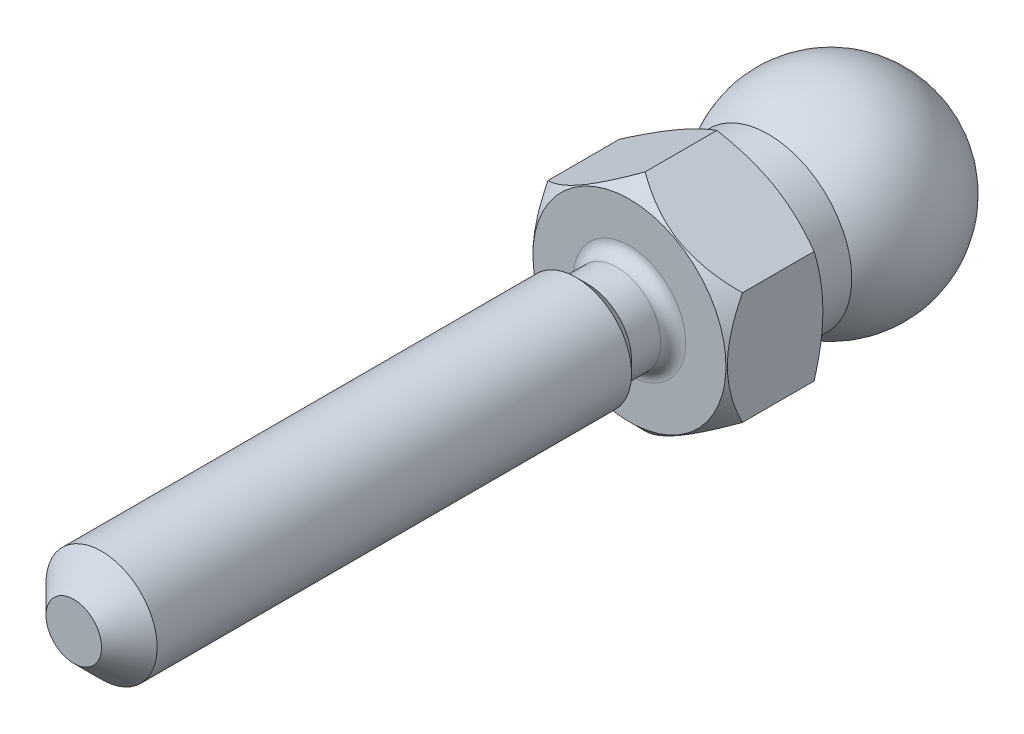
ISO-10303-21;
HEADER;
FILE_DESCRIPTION(('STEP AP214'),'2;1');
FILE_NAME('part.step','',(''),(''),'','','');
FILE_SCHEMA(('AUTOMOTIVE_DESIGN { 1 0 10303 214 1 1 1 1 }'));
ENDSEC;
DATA;
#1=APPLICATION_CONTEXT('core data for automotive mechanical design processes');
#2=APPLICATION_PROTOCOL_DEFINITION('international standard','automotive_design',2000,#1);
#3=PRODUCT_CONTEXT('',#1,'mechanical');
#4=PRODUCT('Part','Part','',(#3));
#5=PRODUCT_RELATED_PRODUCT_CATEGORY('part','',(#4));
#6=PRODUCT_DEFINITION_FORMATION('','',#4);
#7=PRODUCT_DEFINITION_CONTEXT('part definition',#1,'design');
#8=PRODUCT_DEFINITION('design','',#6,#7);
#9=PRODUCT_DEFINITION_SHAPE('','',#8);
#10=(LENGTH_UNIT() NAMED_UNIT(*) SI_UNIT(.MILLI.,.METRE.));
#11=(NAMED_UNIT(*) PLANE_ANGLE_UNIT() SI_UNIT($,.RADIAN.));
#12=(NAMED_UNIT(*) SI_UNIT($,.STERADIAN.) SOLID_ANGLE_UNIT());
#13=UNCERTAINTY_MEASURE_WITH_UNIT(LENGTH_MEASURE(1.E-05),#10,'distance_accuracy_value','');
#14=(GEOMETRIC_REPRESENTATION_CONTEXT(3) GLOBAL_UNCERTAINTY_ASSIGNED_CONTEXT((#13)) GLOBAL_UNIT_ASSIGNED_CONTEXT((#10,
#11,#12)) REPRESENTATION_CONTEXT('',''));
#15=CARTESIAN_POINT('',(0.,0.,0.));
#16=DIRECTION('',(0.,0.,1.));
#17=DIRECTION('',(1.,0.,0.));
#18=AXIS2_PLACEMENT_3D('',#15,#16,#17);
#19=CARTESIAN_POINT('',(0.,0.,-54.5));
#20=DIRECTION('',(-1.,0.,0.));
#21=DIRECTION('',(0.,0.,1.));
#22=AXIS2_PLACEMENT_3D('',#19,#20,#21);
#23=SPHERICAL_SURFACE('',#22,7.50000000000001);
#24=CARTESIAN_POINT('',(7.5,0.,-54.5));
#25=VERTEX_POINT('',#24);
#26=VERTEX_LOOP('',#25);
#27=FACE_BOUND('',#26,.T.);
#28=CARTESIAN_POINT('',(-7.50000000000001,0.,-54.5));
#29=VERTEX_POINT('',#28);
#30=VERTEX_LOOP('',#29);
#31=FACE_BOUND('',#30,.T.);
#32=CARTESIAN_POINT('',(0.,0.,-50.));
#33=DIRECTION('',(0.,0.,-1.));
#34=DIRECTION('',(0.,1.,0.));
#35=AXIS2_PLACEMENT_3D('',#32,#33,#34);
#36=CIRCLE('',#35,6.00000000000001);
#37=CARTESIAN_POINT('',(0.,6.,-50.));
#38=VERTEX_POINT('',#37);
#39=EDGE_CURVE('E20',#38,#38,#36,.F.);
#40=ORIENTED_EDGE('',*,*,#39,.F.);
#41=EDGE_LOOP('',(#40));
#42=FACE_BOUND('',#41,.T.);
#43=ADVANCED_FACE('F16',(#27,#31,#42),#23,.T.);
#44=CARTESIAN_POINT('',(0.,0.,-48.75));
#45=DIRECTION('',(0.,0.,-1.));
#46=DIRECTION('',(0.,1.,0.));
#47=AXIS2_PLACEMENT_3D('',#44,#45,#46);
#48=CYLINDRICAL_SURFACE('',#47,6.00000000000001);
#49=CARTESIAN_POINT('',(0.,0.,-47.5000000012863));
#50=DIRECTION('',(0.,0.,1.));
#51=DIRECTION('',(1.,0.,0.));
#52=AXIS2_PLACEMENT_3D('',#49,#50,#51);
#53=CIRCLE('',#52,6.00000000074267);
#54=CARTESIAN_POINT('',(6.00000000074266,0.,-47.5000000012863));
#55=VERTEX_POINT('',#54);
#56=EDGE_CURVE('E84',#55,#55,#53,.T.);
#57=ORIENTED_EDGE('',*,*,#56,.F.);
#58=EDGE_LOOP('',(#57));
#59=FACE_BOUND('',#58,.T.);
#60=ORIENTED_EDGE('',*,*,#39,.T.);
#61=EDGE_LOOP('',(#60));
#62=FACE_BOUND('',#61,.T.);
#63=ADVANCED_FACE('F80',(#59,#62),#48,.T.);
#64=CARTESIAN_POINT('',(0.,0.,-46.2902195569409));
#65=DIRECTION('',(0.,0.,1.));
#66=DIRECTION('',(0.,-1.,0.));
#67=AXIS2_PLACEMENT_3D('',#64,#65,#66);
#68=CONICAL_SURFACE('',#67,8.09540119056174,1.04719755);
#69=ORIENTED_EDGE('',*,*,#56,.T.);
#70=EDGE_LOOP('',(#69));
#71=FACE_BOUND('',#70,.T.);
#72=CARTESIAN_POINT('',(7.00000000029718,4.04145188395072,-46.2974349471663));
#73=CARTESIAN_POINT('',(7.00000000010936,3.86378247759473,-46.3487137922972));
#74=CARTESIAN_POINT('',(7.00000000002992,3.68545063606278,-46.3976652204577));
#75=CARTESIAN_POINT('',(6.99999999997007,3.32733873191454,-46.4902722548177));
#76=CARTESIAN_POINT('',(6.9999999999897,3.1475580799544,-46.5339255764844));
#77=CARTESIAN_POINT('',(7.00000000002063,2.60533781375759,-46.6560814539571));
#78=CARTESIAN_POINT('',(7.00000000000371,2.24075794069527,-46.7255612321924));
#79=CARTESIAN_POINT('',(6.99999999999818,1.69517083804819,-46.8070325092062));
#80=CARTESIAN_POINT('',(6.99999999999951,1.5157936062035,-46.8302409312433));
#81=CARTESIAN_POINT('',(7.00000000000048,1.15622874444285,-46.8691571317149));
#82=CARTESIAN_POINT('',(7.00000000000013,0.976041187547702,-46.8848655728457));
#83=CARTESIAN_POINT('',(6.99999999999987,0.615353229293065,-46.9083814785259));
#84=CARTESIAN_POINT('',(6.99999999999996,0.434853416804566,-46.9161979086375));
#85=CARTESIAN_POINT('',(7.00000000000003,0.0736971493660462,-46.9237705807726));
#86=CARTESIAN_POINT('',(7.00000000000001,-0.106959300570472,-46.9235270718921));
#87=CARTESIAN_POINT('',(6.99999999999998,-0.601868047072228,-46.911781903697));
#88=CARTESIAN_POINT('',(6.99999999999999,-0.915958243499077,-46.8920747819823));
#89=CARTESIAN_POINT('',(7.,-1.54205253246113,-46.8295900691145));
#90=CARTESIAN_POINT('',(7.,-1.85405442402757,-46.7867911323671));
#91=CARTESIAN_POINT('',(7.,-2.48140815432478,-46.6798088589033));
#92=CARTESIAN_POINT('',(7.,-2.79668085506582,-46.6151723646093));
#93=CARTESIAN_POINT('',(7.,-3.42252533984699,-46.4684746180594));
#94=CARTESIAN_POINT('',(7.,-3.73310513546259,-46.386447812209));
#95=CARTESIAN_POINT('',(7.,-4.04145188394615,-46.2974349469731));
#96=B_SPLINE_CURVE_WITH_KNOTS('',3,(#72,#73,#74,#75,#76,#77,#78,#79,#80,#81,#82,#83,#84,#85,#86,
#87,#88,#89,#90,#91,#92,#93,#94,#95),.UNSPECIFIED.,.F.,.F.,(4,2,2,2,2,2,2,2,2,2,2,4),(0.,
0.554720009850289,1.1096783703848,2.22190068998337,2.76439120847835,3.30683378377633,
3.84865943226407,4.3904683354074,5.33360246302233,6.27760990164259,7.24255090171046,
8.20559812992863),.UNSPECIFIED.);
#97=CARTESIAN_POINT('',(6.99999999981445,4.04145188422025,-46.2974349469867));
#98=VERTEX_POINT('',#97);
#99=CARTESIAN_POINT('',(6.99999999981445,-4.04145188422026,-46.2974349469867));
#100=VERTEX_POINT('',#99);
#101=EDGE_CURVE('E140',#98,#100,#96,.T.);
#102=ORIENTED_EDGE('',*,*,#101,.T.);
#103=CARTESIAN_POINT('',(6.99999999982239,-4.04145188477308,-46.2974349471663));
#104=CARTESIAN_POINT('',(6.84613378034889,-4.13028658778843,-46.3487137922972));
#105=CARTESIAN_POINT('',(6.69169387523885,-4.2194525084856,-46.3976652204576));
#106=CARTESIAN_POINT('',(6.38155986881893,-4.39850846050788,-46.4902722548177));
#107=CARTESIAN_POINT('',(6.22586525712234,-4.48839878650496,-46.5339255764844));
#108=CARTESIAN_POINT('',(5.7562887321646,-4.75950891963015,-46.6560814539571));
#109=CARTESIAN_POINT('',(5.44055330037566,-4.94179885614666,-46.7255612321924));
#110=CARTESIAN_POINT('',(4.96806100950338,-5.21459240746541,-46.8070325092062));
#111=CARTESIAN_POINT('',(4.81271576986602,-5.3042810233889,-46.8302409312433));
#112=CARTESIAN_POINT('',(4.50132346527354,-5.48406345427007,-46.8691571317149));
#113=CARTESIAN_POINT('',(4.34527646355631,-5.57415723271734,-46.8848655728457));
#114=CARTESIAN_POINT('',(4.03291152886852,-5.75450121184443,-46.9083814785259));
#115=CARTESIAN_POINT('',(3.8765941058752,-5.84475111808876,-46.9161979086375));
#116=CARTESIAN_POINT('',(3.56382360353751,-6.02532925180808,-46.9237705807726));
#117=CARTESIAN_POINT('',(3.40737052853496,-6.11565747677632,-46.9235270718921));
#118=CARTESIAN_POINT('',(2.97876698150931,-6.36311185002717,-46.911781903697));
#119=CARTESIAN_POINT('',(2.70675689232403,-6.52015694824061,-46.8920747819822));
#120=CARTESIAN_POINT('',(2.16454333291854,-6.83320409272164,-46.8295900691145));
#121=CARTESIAN_POINT('',(1.8943417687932,-6.98920503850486,-46.7867911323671));
#122=CARTESIAN_POINT('',(1.35103750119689,-7.30288190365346,-46.6798088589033));
#123=CARTESIAN_POINT('',(1.07800333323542,-7.46051825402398,-46.6151723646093));
#124=CARTESIAN_POINT('',(0.536006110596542,-7.77344049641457,-46.4684746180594));
#125=CARTESIAN_POINT('',(0.267036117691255,-7.92873039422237,-46.386447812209));
#126=CARTESIAN_POINT('',(3.30158350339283E-10,-8.08290376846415,-46.2974349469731));
#127=B_SPLINE_CURVE_WITH_KNOTS('',3,(#103,#104,#105,#106,#107,#108,#109,#110,#111,#112,#113,
#114,#115,#116,#117,#118,#119,#120,#121,#122,#123,#124,#125,#126),.UNSPECIFIED.,.F.,.F.,(4,2,2,
2,2,2,2,2,2,2,2,4),(0.,0.554720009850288,1.1096783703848,2.22190068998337,2.76439120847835,
3.30683378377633,3.84865943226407,4.3904683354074,5.33360246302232,6.27760990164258,
7.24255090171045,8.20559812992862),.UNSPECIFIED.);
#128=CARTESIAN_POINT('',(0.,-8.08290376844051,-46.2974349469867));
#129=VERTEX_POINT('',#128);
#130=EDGE_CURVE('E71',#100,#129,#127,.T.);
#131=ORIENTED_EDGE('',*,*,#130,.T.);
#132=CARTESIAN_POINT('',(-4.7479887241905E-10,-8.08290376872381,-46.2974349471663));
#133=CARTESIAN_POINT('',(-0.153866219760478,-7.99406906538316,-46.3487137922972));
#134=CARTESIAN_POINT('',(-0.308306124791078,-7.90490314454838,-46.3976652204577));
#135=CARTESIAN_POINT('',(-0.618440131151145,-7.72584719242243,-46.4902722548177));
#136=CARTESIAN_POINT('',(-0.774134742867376,-7.63595686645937,-46.5339255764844));
#137=CARTESIAN_POINT('',(-1.24371126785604,-7.36484673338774,-46.6560814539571));
#138=CARTESIAN_POINT('',(-1.55944669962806,-7.18255679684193,-46.7255612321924));
#139=CARTESIAN_POINT('',(-2.03193899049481,-6.9097632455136,-46.8070325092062));
#140=CARTESIAN_POINT('',(-2.1872842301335,-6.82007462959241,-46.8302409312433));
#141=CARTESIAN_POINT('',(-2.49867653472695,-6.64029219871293,-46.8691571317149));
#142=CARTESIAN_POINT('',(-2.65472353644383,-6.55019842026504,-46.8848655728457));
#143=CARTESIAN_POINT('',(-2.96708847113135,-6.3698544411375,-46.9083814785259));
#144=CARTESIAN_POINT('',(-3.12340589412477,-6.27960453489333,-46.9161979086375));
#145=CARTESIAN_POINT('',(-3.43617639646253,-6.09902640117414,-46.9237705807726));
#146=CARTESIAN_POINT('',(-3.59262947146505,-6.00869817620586,-46.9235270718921));
#147=CARTESIAN_POINT('',(-4.02123301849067,-5.76124380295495,-46.911781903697));
#148=CARTESIAN_POINT('',(-4.29324310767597,-5.60419870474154,-46.8920747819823));
#149=CARTESIAN_POINT('',(-4.83545666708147,-5.29115156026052,-46.8295900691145));
#150=CARTESIAN_POINT('',(-5.1056582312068,-5.1351506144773,-46.7867911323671));
#151=CARTESIAN_POINT('',(-5.64896249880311,-4.82147374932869,-46.6798088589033));
#152=CARTESIAN_POINT('',(-5.92199666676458,-4.66383739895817,-46.6151723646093));
#153=CARTESIAN_POINT('',(-6.46399388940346,-4.35091515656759,-46.4684746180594));
#154=CARTESIAN_POINT('',(-6.73296388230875,-4.19562525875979,-46.386447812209));
#155=CARTESIAN_POINT('',(-6.99999999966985,-4.04145188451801,-46.2974349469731));
#156=B_SPLINE_CURVE_WITH_KNOTS('',3,(#132,#133,#134,#135,#136,#137,#138,#139,#140,#141,#142,
#143,#144,#145,#146,#147,#148,#149,#150,#151,#152,#153,#154,#155),.UNSPECIFIED.,.F.,.F.,(4,2,2,
2,2,2,2,2,2,2,2,4),(0.,0.554720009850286,1.1096783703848,2.22190068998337,2.76439120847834,
3.30683378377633,3.84865943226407,4.39046833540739,5.33360246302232,6.27760990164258,
7.24255090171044,8.20559812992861),.UNSPECIFIED.);
#157=CARTESIAN_POINT('',(-6.99999999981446,-4.04145188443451,-46.2974349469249));
#158=VERTEX_POINT('',#157);
#159=EDGE_CURVE('E86',#129,#158,#156,.T.);
#160=ORIENTED_EDGE('',*,*,#159,.T.);
#161=CARTESIAN_POINT('',(-7.00000000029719,-4.04145188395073,-46.2974349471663));
#162=CARTESIAN_POINT('',(-7.00000000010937,-3.86378247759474,-46.3487137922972));
#163=CARTESIAN_POINT('',(-7.00000000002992,-3.6854506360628,-46.3976652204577));
#164=CARTESIAN_POINT('',(-6.99999999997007,-3.32733873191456,-46.4902722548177));
#165=CARTESIAN_POINT('',(-6.99999999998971,-3.14755807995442,-46.5339255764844));
#166=CARTESIAN_POINT('',(-7.00000000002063,-2.6053378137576,-46.6560814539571));
#167=CARTESIAN_POINT('',(-7.00000000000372,-2.24075794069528,-46.7255612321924));
#168=CARTESIAN_POINT('',(-6.99999999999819,-1.6951708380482,-46.8070325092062));
#169=CARTESIAN_POINT('',(-6.99999999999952,-1.51579360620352,-46.8302409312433));
#170=CARTESIAN_POINT('',(-7.00000000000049,-1.15622874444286,-46.8691571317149));
#171=CARTESIAN_POINT('',(-7.00000000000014,-0.976041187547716,-46.8848655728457));
#172=CARTESIAN_POINT('',(-6.99999999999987,-0.615353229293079,-46.9083814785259));
#173=CARTESIAN_POINT('',(-6.99999999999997,-0.43485341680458,-46.9161979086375));
#174=CARTESIAN_POINT('',(-7.00000000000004,-0.0736971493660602,-46.9237705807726));
#175=CARTESIAN_POINT('',(-7.00000000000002,0.106959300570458,-46.9235270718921));
#176=CARTESIAN_POINT('',(-6.99999999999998,0.601868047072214,-46.911781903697));
#177=CARTESIAN_POINT('',(-7.,0.915958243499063,-46.8920747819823));
#178=CARTESIAN_POINT('',(-7.00000000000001,1.54205253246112,-46.8295900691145));
#179=CARTESIAN_POINT('',(-7.00000000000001,1.85405442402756,-46.7867911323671));
#180=CARTESIAN_POINT('',(-7.,2.48140815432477,-46.6798088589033));
#181=CARTESIAN_POINT('',(-7.,2.79668085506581,-46.6151723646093));
#182=CARTESIAN_POINT('',(-7.00000000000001,3.42252533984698,-46.4684746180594));
#183=CARTESIAN_POINT('',(-7.00000000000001,3.73310513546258,-46.386447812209));
#184=CARTESIAN_POINT('',(-7.,4.04145188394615,-46.2974349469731));
#185=B_SPLINE_CURVE_WITH_KNOTS('',3,(#161,#162,#163,#164,#165,#166,#167,#168,#169,#170,#171,
#172,#173,#174,#175,#176,#177,#178,#179,#180,#181,#182,#183,#184),.UNSPECIFIED.,.F.,.F.,(4,2,2,
2,2,2,2,2,2,2,2,4),(0.,0.554720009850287,1.1096783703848,2.22190068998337,2.76439120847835,
3.30683378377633,3.84865943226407,4.3904683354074,5.33360246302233,6.27760990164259,
7.24255090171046,8.20559812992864),.UNSPECIFIED.);
#186=CARTESIAN_POINT('',(-6.99999999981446,4.04145188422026,-46.2974349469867));
#187=VERTEX_POINT('',#186);
#188=EDGE_CURVE('E121',#158,#187,#185,.T.);
#189=ORIENTED_EDGE('',*,*,#188,.T.);
#190=CARTESIAN_POINT('',(-6.9999999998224,4.04145188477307,-46.2974349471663));
#191=CARTESIAN_POINT('',(-6.8461337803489,4.13028658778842,-46.3487137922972));
#192=CARTESIAN_POINT('',(-6.69169387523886,4.21945250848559,-46.3976652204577));
#193=CARTESIAN_POINT('',(-6.38155986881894,4.39850846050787,-46.4902722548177));
#194=CARTESIAN_POINT('',(-6.22586525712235,4.48839878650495,-46.5339255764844));
#195=CARTESIAN_POINT('',(-5.75628873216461,4.75950891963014,-46.6560814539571));
#196=CARTESIAN_POINT('',(-5.44055330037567,4.94179885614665,-46.7255612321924));
#197=CARTESIAN_POINT('',(-4.96806100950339,5.2145924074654,-46.8070325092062));
#198=CARTESIAN_POINT('',(-4.81271576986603,5.30428102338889,-46.8302409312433));
#199=CARTESIAN_POINT('',(-4.50132346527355,5.48406345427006,-46.8691571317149));
#200=CARTESIAN_POINT('',(-4.34527646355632,5.57415723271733,-46.8848655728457));
#201=CARTESIAN_POINT('',(-4.03291152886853,5.75450121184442,-46.9083814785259));
#202=CARTESIAN_POINT('',(-3.87659410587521,5.84475111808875,-46.9161979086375));
#203=CARTESIAN_POINT('',(-3.56382360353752,6.02532925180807,-46.9237705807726));
#204=CARTESIAN_POINT('',(-3.40737052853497,6.11565747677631,-46.9235270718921));
#205=CARTESIAN_POINT('',(-2.97876698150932,6.36311185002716,-46.911781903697));
#206=CARTESIAN_POINT('',(-2.70675689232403,6.5201569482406,-46.8920747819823));
#207=CARTESIAN_POINT('',(-2.16454333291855,6.83320409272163,-46.8295900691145));
#208=CARTESIAN_POINT('',(-1.89434176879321,6.98920503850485,-46.7867911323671));
#209=CARTESIAN_POINT('',(-1.35103750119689,7.30288190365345,-46.6798088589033));
#210=CARTESIAN_POINT('',(-1.07800333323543,7.46051825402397,-46.6151723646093));
#211=CARTESIAN_POINT('',(-0.536006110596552,7.77344049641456,-46.4684746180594));
#212=CARTESIAN_POINT('',(-0.267036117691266,7.92873039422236,-46.386447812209));
#213=CARTESIAN_POINT('',(-3.30168395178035E-10,8.08290376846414,-46.2974349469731));
#214=B_SPLINE_CURVE_WITH_KNOTS('',3,(#190,#191,#192,#193,#194,#195,#196,#197,#198,#199,#200,
#201,#202,#203,#204,#205,#206,#207,#208,#209,#210,#211,#212,#213),.UNSPECIFIED.,.F.,.F.,(4,2,2,
2,2,2,2,2,2,2,2,4),(0.,0.554720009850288,1.10967837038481,2.22190068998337,2.76439120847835,
3.30683378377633,3.84865943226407,4.3904683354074,5.33360246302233,6.27760990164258,
7.24255090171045,8.20559812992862),.UNSPECIFIED.);
#215=CARTESIAN_POINT('',(0.,8.0829037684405,-46.2974349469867));
#216=VERTEX_POINT('',#215);
#217=EDGE_CURVE('E129',#187,#216,#214,.T.);
#218=ORIENTED_EDGE('',*,*,#217,.T.);
#219=CARTESIAN_POINT('',(4.74782038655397E-10,8.0829037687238,-46.2974349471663));
#220=CARTESIAN_POINT('',(0.153866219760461,7.99406906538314,-46.3487137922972));
#221=CARTESIAN_POINT('',(0.308306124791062,7.90490314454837,-46.3976652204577));
#222=CARTESIAN_POINT('',(0.618440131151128,7.72584719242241,-46.4902722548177));
#223=CARTESIAN_POINT('',(0.774134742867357,7.63595686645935,-46.5339255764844));
#224=CARTESIAN_POINT('',(1.24371126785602,7.36484673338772,-46.6560814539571));
#225=CARTESIAN_POINT('',(1.55944669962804,7.18255679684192,-46.7255612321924));
#226=CARTESIAN_POINT('',(2.03193899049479,6.90976324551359,-46.8070325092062));
#227=CARTESIAN_POINT('',(2.18728423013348,6.8200746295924,-46.8302409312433));
#228=CARTESIAN_POINT('',(2.49867653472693,6.64029219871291,-46.8691571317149));
#229=CARTESIAN_POINT('',(2.65472353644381,6.55019842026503,-46.8848655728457));
#230=CARTESIAN_POINT('',(2.96708847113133,6.36985444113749,-46.9083814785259));
#231=CARTESIAN_POINT('',(3.12340589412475,6.27960453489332,-46.9161979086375));
#232=CARTESIAN_POINT('',(3.43617639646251,6.09902640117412,-46.9237705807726));
#233=CARTESIAN_POINT('',(3.59262947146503,6.00869817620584,-46.9235270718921));
#234=CARTESIAN_POINT('',(4.02123301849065,5.76124380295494,-46.911781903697));
#235=CARTESIAN_POINT('',(4.29324310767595,5.60419870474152,-46.8920747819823));
#236=CARTESIAN_POINT('',(4.83545666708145,5.29115156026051,-46.8295900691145));
#237=CARTESIAN_POINT('',(5.10565823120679,5.13515061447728,-46.7867911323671));
#238=CARTESIAN_POINT('',(5.6489624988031,4.82147374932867,-46.6798088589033));
#239=CARTESIAN_POINT('',(5.92199666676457,4.66383739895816,-46.6151723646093));
#240=CARTESIAN_POINT('',(6.46399388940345,4.35091515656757,-46.4684746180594));
#241=CARTESIAN_POINT('',(6.73296388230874,4.19562525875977,-46.386447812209));
#242=CARTESIAN_POINT('',(6.99999999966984,4.04145188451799,-46.2974349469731));
#243=B_SPLINE_CURVE_WITH_KNOTS('',3,(#219,#220,#221,#222,#223,#224,#225,#226,#227,#228,#229,
#230,#231,#232,#233,#234,#235,#236,#237,#238,#239,#240,#241,#242),.UNSPECIFIED.,.F.,.F.,(4,2,2,
2,2,2,2,2,2,2,2,4),(0.,0.554720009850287,1.1096783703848,2.22190068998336,2.76439120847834,
3.30683378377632,3.84865943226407,4.39046833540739,5.33360246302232,6.27760990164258,
7.24255090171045,8.20559812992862),.UNSPECIFIED.);
#244=EDGE_CURVE('E135',#216,#98,#243,.T.);
#245=ORIENTED_EDGE('',*,*,#244,.T.);
#246=EDGE_LOOP('',(#102,#131,#160,#189,#218,#245));
#247=FACE_BOUND('',#246,.T.);
#248=ADVANCED_FACE('F103',(#71,#247),#68,.T.);
#249=CARTESIAN_POINT('',(0.,-8.08290376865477,-40.));
#250=DIRECTION('',(0.5,0.866025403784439,0.));
#251=DIRECTION('',(-0.866025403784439,0.5,0.));
#252=AXIS2_PLACEMENT_3D('',#249,#250,#251);
#253=PLANE('',#252);
#254=DIRECTION('',(0.,0.,-1.));
#255=VECTOR('',#254,1.);
#256=CARTESIAN_POINT('',(-7.,-4.04145188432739,-40.));
#257=LINE('',#256,#255);
#258=CARTESIAN_POINT('',(-6.99999996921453,-4.04145190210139,-41.1329037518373));
#259=VERTEX_POINT('',#258);
#260=EDGE_CURVE('E255',#259,#158,#257,.T.);
#261=ORIENTED_EDGE('',*,*,#260,.T.);
#262=ORIENTED_EDGE('',*,*,#159,.F.);
#263=DIRECTION('',(0.,0.,1.));
#264=VECTOR('',#263,1.);
#265=CARTESIAN_POINT('',(0.,-8.08290376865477,-40.));
#266=LINE('',#265,#264);
#267=CARTESIAN_POINT('',(-5.95870114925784E-09,-8.08290377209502,-41.1329037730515));
#268=VERTEX_POINT('',#267);
#269=EDGE_CURVE('E92',#129,#268,#266,.T.);
#270=ORIENTED_EDGE('',*,*,#269,.T.);
#271=CARTESIAN_POINT('',(-6.99999993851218,-4.04145191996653,-41.1329037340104));
#272=CARTESIAN_POINT('',(-6.87964650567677,-4.11093800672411,-41.0634280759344));
#273=CARTESIAN_POINT('',(-6.75836801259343,-4.18095817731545,-40.996084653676));
#274=CARTESIAN_POINT('',(-6.51377945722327,-4.322171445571,-40.8663108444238));
#275=CARTESIAN_POINT('',(-6.39046832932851,-4.39336515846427,-40.8038831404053));
#276=CARTESIAN_POINT('',(-6.01606848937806,-4.60952500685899,-40.6244142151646));
#277=CARTESIAN_POINT('',(-5.76181050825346,-4.75632092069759,-40.5159526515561));
#278=CARTESIAN_POINT('',(-5.24907912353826,-5.05234652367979,-40.3302203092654));
#279=CARTESIAN_POINT('',(-4.99073673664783,-5.20150057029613,-40.252481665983));
#280=CARTESIAN_POINT('',(-4.5989764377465,-5.42768348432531,-40.1625576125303));
#281=CARTESIAN_POINT('',(-4.46781295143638,-5.50341075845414,-40.1370422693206));
#282=CARTESIAN_POINT('',(-4.20437555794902,-5.65550640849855,-40.0954835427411));
#283=CARTESIAN_POINT('',(-4.07210181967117,-5.73187468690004,-40.0794387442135));
#284=CARTESIAN_POINT('',(-3.74975742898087,-5.91798030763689,-40.0525366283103));
#285=CARTESIAN_POINT('',(-3.55933944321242,-6.02791818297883,-40.0468928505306));
#286=CARTESIAN_POINT('',(-3.17884679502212,-6.24759571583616,-40.0563708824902));
#287=CARTESIAN_POINT('',(-2.98877227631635,-6.35733529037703,-40.0714999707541));
#288=CARTESIAN_POINT('',(-2.61041536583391,-6.57577975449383,-40.1216319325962));
#289=CARTESIAN_POINT('',(-2.42213521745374,-6.68448334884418,-40.1566570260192));
#290=CARTESIAN_POINT('',(-2.04881104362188,-6.900022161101,-40.2446768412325));
#291=CARTESIAN_POINT('',(-1.8637667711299,-7.00685752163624,-40.2976701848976));
#292=CARTESIAN_POINT('',(-1.53530254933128,-7.19649642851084,-40.4066858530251));
#293=CARTESIAN_POINT('',(-1.39115484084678,-7.27972014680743,-40.4598394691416));
#294=CARTESIAN_POINT('',(-1.10544664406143,-7.44467385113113,-40.5747109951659));
#295=CARTESIAN_POINT('',(-0.96388623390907,-7.52640379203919,-40.636429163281));
#296=CARTESIAN_POINT('',(-0.683798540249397,-7.68811249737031,-40.7670466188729));
#297=CARTESIAN_POINT('',(-0.545263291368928,-7.7680958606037,-40.8359233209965));
#298=CARTESIAN_POINT('',(-0.270757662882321,-7.92658175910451,-40.9799538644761));
#299=CARTESIAN_POINT('',(-0.134785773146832,-8.00508516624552,-41.0551038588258));
#300=CARTESIAN_POINT('',(-6.15624390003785E-08,-8.08290373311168,-41.1329037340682));
#301=B_SPLINE_CURVE_WITH_KNOTS('',3,(#271,#272,#273,#274,#275,#276,#277,#278,#279,#280,#281,
#282,#283,#284,#285,#286,#287,#288,#289,#290,#291,#292,#293,#294,#295,#296,#297,#298,#299,#300),
.UNSPECIFIED.,.F.,.F.,(4,2,2,2,2,2,2,2,2,2,2,2,2,2,4),(0.,0.466085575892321,0.932423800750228,
1.87013394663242,2.79295642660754,3.2534628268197,3.71390039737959,4.37271966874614,
5.03176984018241,5.69155748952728,6.35129454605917,6.87523426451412,7.39918978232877,
7.9215396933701,8.44357160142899),.UNSPECIFIED.);
#302=EDGE_CURVE('E254',#259,#268,#301,.T.);
#303=ORIENTED_EDGE('',*,*,#302,.F.);
#304=EDGE_LOOP('',(#261,#262,#270,#303));
#305=FACE_BOUND('',#304,.T.);
#306=ADVANCED_FACE('F108',(#305),#253,.F.);
#307=CARTESIAN_POINT('',(7.,-4.04145188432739,-40.));
#308=DIRECTION('',(-0.5,0.866025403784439,0.));
#309=DIRECTION('',(-0.866025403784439,-0.5,0.));
#310=AXIS2_PLACEMENT_3D('',#307,#308,#309);
#311=PLANE('',#310);
#312=ORIENTED_EDGE('',*,*,#269,.F.);
#313=ORIENTED_EDGE('',*,*,#130,.F.);
#314=DIRECTION('',(0.,0.,1.));
#315=VECTOR('',#314,1.);
#316=CARTESIAN_POINT('',(7.,-4.04145188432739,-40.));
#317=LINE('',#316,#315);
#318=CARTESIAN_POINT('',(7.,-4.04145189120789,-41.1329037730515));
#319=VERTEX_POINT('',#318);
#320=EDGE_CURVE('E145',#100,#319,#317,.T.);
#321=ORIENTED_EDGE('',*,*,#320,.T.);
#322=CARTESIAN_POINT('',(-2.13753986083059E-08,-8.0829037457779,-41.1329037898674));
#323=CARTESIAN_POINT('',(0.120353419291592,-8.01341767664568,-41.0634281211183));
#324=CARTESIAN_POINT('',(0.241631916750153,-7.94339751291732,-40.9960846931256));
#325=CARTESIAN_POINT('',(0.486220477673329,-7.80218424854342,-40.8663108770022));
#326=CARTESIAN_POINT('',(0.609531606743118,-7.73099053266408,-40.8038831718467));
#327=CARTESIAN_POINT('',(0.983931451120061,-7.51483067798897,-40.6244142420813));
#328=CARTESIAN_POINT('',(1.23818943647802,-7.36803476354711,-40.5159526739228));
#329=CARTESIAN_POINT('',(1.75092082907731,-7.07200915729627,-40.3302203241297));
#330=CARTESIAN_POINT('',(2.00926321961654,-6.92285510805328,-40.2524816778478));
#331=CARTESIAN_POINT('',(2.4010235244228,-6.69667219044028,-40.1625576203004));
#332=CARTESIAN_POINT('',(2.53218701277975,-6.62094491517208,-40.1370422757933));
#333=CARTESIAN_POINT('',(2.79562441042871,-6.46884926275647,-40.0954835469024));
#334=CARTESIAN_POINT('',(2.92789815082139,-6.39248098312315,-40.0794387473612));
#335=CARTESIAN_POINT('',(3.25024254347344,-6.20637536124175,-40.0525366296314));
#336=CARTESIAN_POINT('',(3.4406605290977,-6.0964374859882,-40.0468928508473));
#337=CARTESIAN_POINT('',(3.82115317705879,-5.87675995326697,-40.0563708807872));
#338=CARTESIAN_POINT('',(4.01122769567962,-5.76702037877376,-40.0714999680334));
#339=CARTESIAN_POINT('',(4.38958460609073,-5.54857591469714,-40.1216319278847));
#340=CARTESIAN_POINT('',(4.57786475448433,-5.4398723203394,-40.1566570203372));
#341=CARTESIAN_POINT('',(4.95118892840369,-5.22433350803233,-40.2446768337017));
#342=CARTESIAN_POINT('',(5.13623320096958,-5.11749814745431,-40.2976701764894));
#343=CARTESIAN_POINT('',(5.46469742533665,-4.92785923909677,-40.4066858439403));
#344=CARTESIAN_POINT('',(5.60884513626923,-4.84463551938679,-40.4598394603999));
#345=CARTESIAN_POINT('',(5.89455333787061,-4.67968181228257,-40.5747109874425));
#346=CARTESIAN_POINT('',(6.0361137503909,-4.59795187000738,-40.6364291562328));
#347=CARTESIAN_POINT('',(6.31620144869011,-4.43624316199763,-40.7670466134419));
#348=CARTESIAN_POINT('',(6.45473669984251,-4.35625979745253,-40.8359233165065));
#349=CARTESIAN_POINT('',(6.72924233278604,-4.19777389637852,-40.9799538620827));
#350=CARTESIAN_POINT('',(6.86521422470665,-4.11927048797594,-41.0551038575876));
#351=CARTESIAN_POINT('',(6.99999993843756,-4.04145191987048,-41.1329037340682));
#352=B_SPLINE_CURVE_WITH_KNOTS('',3,(#322,#323,#324,#325,#326,#327,#328,#329,#330,#331,#332,
#333,#334,#335,#336,#337,#338,#339,#340,#341,#342,#343,#344,#345,#346,#347,#348,#349,#350,#351),
.UNSPECIFIED.,.F.,.F.,(4,2,2,2,2,2,2,2,2,2,2,2,2,2,4),(0.,0.466085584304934,0.932423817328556,
1.87013397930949,2.79295647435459,3.25346288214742,3.71390046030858,4.37271973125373,
5.03176990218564,5.69155755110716,6.35129460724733,6.87523433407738,7.39918986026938,
7.92153977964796,8.44357169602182),.UNSPECIFIED.);
#353=EDGE_CURVE('E165',#268,#319,#352,.T.);
#354=ORIENTED_EDGE('',*,*,#353,.F.);
#355=EDGE_LOOP('',(#312,#313,#321,#354));
#356=FACE_BOUND('',#355,.T.);
#357=ADVANCED_FACE('F150',(#356),#311,.F.);
#358=CARTESIAN_POINT('',(7.,4.04145188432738,-40.));
#359=DIRECTION('',(-1.,0.,0.));
#360=DIRECTION('',(0.,0.,1.));
#361=AXIS2_PLACEMENT_3D('',#358,#359,#360);
#362=PLANE('',#361);
#363=ORIENTED_EDGE('',*,*,#320,.F.);
#364=ORIENTED_EDGE('',*,*,#101,.F.);
#365=DIRECTION('',(0.,0.,1.));
#366=VECTOR('',#365,1.);
#367=CARTESIAN_POINT('',(6.99999999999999,4.04145188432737,-40.));
#368=LINE('',#367,#366);
#369=CARTESIAN_POINT('',(7.00000000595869,4.04145188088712,-41.1329037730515));
#370=VERTEX_POINT('',#369);
#371=EDGE_CURVE('E260',#98,#370,#368,.T.);
#372=ORIENTED_EDGE('',*,*,#371,.T.);
#373=CARTESIAN_POINT('',(6.99999996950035,-4.04145189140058,-41.1329037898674));
#374=CARTESIAN_POINT('',(6.99999998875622,-3.90247971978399,-41.0634281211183));
#375=CARTESIAN_POINT('',(6.9999999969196,-3.7624393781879,-40.9960846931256));
#376=CARTESIAN_POINT('',(7.00000000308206,-3.4800128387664,-40.8663108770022));
#377=CARTESIAN_POINT('',(7.00000000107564,-3.33762541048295,-40.8038831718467));
#378=CARTESIAN_POINT('',(6.99999999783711,-2.90530570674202,-40.6244142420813));
#379=CARTESIAN_POINT('',(6.99999999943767,-2.61171387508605,-40.5159526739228));
#380=CARTESIAN_POINT('',(7.0000000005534,-2.01966266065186,-40.3302203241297));
#381=CARTESIAN_POINT('',(7.00000000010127,-1.721354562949,-40.2524816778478));
#382=CARTESIAN_POINT('',(6.99999999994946,-1.26898872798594,-40.1625576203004));
#383=CARTESIAN_POINT('',(6.9999999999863,-1.11753417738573,-40.1370422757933));
#384=CARTESIAN_POINT('',(7.00000000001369,-0.813342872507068,-40.0954835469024));
#385=CARTESIAN_POINT('',(7.00000000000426,-0.66060631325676,-40.0794387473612));
#386=CARTESIAN_POINT('',(6.99999999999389,-0.288395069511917,-40.0525366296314));
#387=CARTESIAN_POINT('',(6.99999999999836,-0.0685193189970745,-40.0468928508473));
#388=CARTESIAN_POINT('',(7.00000000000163,0.370835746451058,-40.0563708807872));
#389=CARTESIAN_POINT('',(7.00000000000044,0.590314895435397,-40.0714999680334));
#390=CARTESIAN_POINT('',(6.99999999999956,1.02720382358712,-40.1216319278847));
#391=CARTESIAN_POINT('',(6.99999999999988,1.24461101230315,-40.1566570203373));
#392=CARTESIAN_POINT('',(7.00000000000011,1.67568863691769,-40.2446768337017));
#393=CARTESIAN_POINT('',(7.00000000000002,1.88935935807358,-40.2976701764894));
#394=CARTESIAN_POINT('',(6.99999999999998,2.26863717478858,-40.4066858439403));
#395=CARTESIAN_POINT('',(6.99999999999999,2.43508461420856,-40.4598394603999));
#396=CARTESIAN_POINT('',(7.,2.76499202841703,-40.5747109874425));
#397=CARTESIAN_POINT('',(7.,2.9284519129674,-40.6364291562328));
#398=CARTESIAN_POINT('',(7.,3.2518693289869,-40.767046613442));
#399=CARTESIAN_POINT('',(7.,3.41183605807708,-40.8359233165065));
#400=CARTESIAN_POINT('',(7.,3.72880786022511,-40.9799538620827));
#401=CARTESIAN_POINT('',(7.,3.88581467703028,-41.0551038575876));
#402=CARTESIAN_POINT('',(7.,4.0414518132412,-41.1329037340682));
#403=B_SPLINE_CURVE_WITH_KNOTS('',3,(#373,#374,#375,#376,#377,#378,#379,#380,#381,#382,#383,
#384,#385,#386,#387,#388,#389,#390,#391,#392,#393,#394,#395,#396,#397,#398,#399,#400,#401,#402),
.UNSPECIFIED.,.F.,.F.,(4,2,2,2,2,2,2,2,2,2,2,2,2,2,4),(0.,0.466085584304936,0.932423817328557,
1.87013397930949,2.79295647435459,3.25346288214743,3.71390046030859,4.37271973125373,
5.03176990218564,5.69155755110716,6.35129460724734,6.87523433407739,7.39918986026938,
7.92153977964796,8.44357169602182),.UNSPECIFIED.);
#404=EDGE_CURVE('E156',#319,#370,#403,.T.);
#405=ORIENTED_EDGE('',*,*,#404,.F.);
#406=EDGE_LOOP('',(#363,#364,#372,#405));
#407=FACE_BOUND('',#406,.T.);
#408=ADVANCED_FACE('F146',(#407),#362,.F.);
#409=CARTESIAN_POINT('',(0.,8.08290376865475,-40.));
#410=DIRECTION('',(-0.5,-0.866025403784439,0.));
#411=DIRECTION('',(0.866025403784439,-0.5,0.));
#412=AXIS2_PLACEMENT_3D('',#409,#410,#411);
#413=PLANE('',#412);
#414=ORIENTED_EDGE('',*,*,#371,.F.);
#415=ORIENTED_EDGE('',*,*,#244,.F.);
#416=DIRECTION('',(0.,0.,1.));
#417=VECTOR('',#416,1.);
#418=CARTESIAN_POINT('',(0.,8.08290376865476,-40.));
#419=LINE('',#418,#417);
#420=CARTESIAN_POINT('',(-1.24133965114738E-08,8.08290376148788,-41.1329037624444));
#421=VERTEX_POINT('',#420);
#422=EDGE_CURVE('E258',#216,#421,#419,.T.);
#423=ORIENTED_EDGE('',*,*,#422,.T.);
#424=CARTESIAN_POINT('',(6.99999999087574,4.04145185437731,-41.1329037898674));
#425=CARTESIAN_POINT('',(6.87964656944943,4.11093795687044,-41.0634281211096));
#426=CARTESIAN_POINT('',(6.75836808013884,4.18095813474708,-40.9960846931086));
#427=CARTESIAN_POINT('',(6.51377952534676,4.32217140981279,-40.86631087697));
#428=CARTESIAN_POINT('',(6.39046839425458,4.39336512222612,-40.8038831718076));
#429=CARTESIAN_POINT('',(6.01606854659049,4.60952497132,-40.624414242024));
#430=CARTESIAN_POINT('',(5.76181056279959,4.75632088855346,-40.5159526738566));
#431=CARTESIAN_POINT('',(5.24907917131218,5.05234649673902,-40.3302203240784));
#432=CARTESIAN_POINT('',(4.99073678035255,5.20150054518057,-40.2524816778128));
#433=CARTESIAN_POINT('',(4.59897647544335,5.42768346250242,-40.1625576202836));
#434=CARTESIAN_POINT('',(4.46781298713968,5.50341073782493,-40.1370422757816));
#435=CARTESIAN_POINT('',(4.20437558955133,5.65550639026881,-40.0954835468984));
#436=CARTESIAN_POINT('',(4.072101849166,5.73187466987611,-40.0794387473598));
#437=CARTESIAN_POINT('',(3.74975745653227,5.91798029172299,-40.0525366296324));
#438=CARTESIAN_POINT('',(3.55933947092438,6.02791816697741,-40.046892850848));
#439=CARTESIAN_POINT('',(3.17884682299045,6.24759569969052,-40.0563708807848));
#440=CARTESIAN_POINT('',(2.98877230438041,6.35733527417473,-40.071499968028));
#441=CARTESIAN_POINT('',(2.61041539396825,6.57577973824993,-40.1216319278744));
#442=CARTESIAN_POINT('',(2.42213524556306,6.6844833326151,-40.1566570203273));
#443=CARTESIAN_POINT('',(2.0488110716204,6.90002214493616,-40.2446768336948));
#444=CARTESIAN_POINT('',(1.8637667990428,7.00685750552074,-40.2976701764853));
#445=CARTESIAN_POINT('',(1.53530257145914,7.19649641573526,-40.4066858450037));
#446=CARTESIAN_POINT('',(1.39115485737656,7.27972013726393,-40.459839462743));
#447=CARTESIAN_POINT('',(1.10544664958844,7.4446738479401,-40.5747109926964));
#448=CARTESIAN_POINT('',(0.963886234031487,7.5264037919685,-40.6364291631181));
#449=CARTESIAN_POINT('',(0.683798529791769,7.688112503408,-40.7670466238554));
#450=CARTESIAN_POINT('',(0.54526327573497,7.76809586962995,-40.8359233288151));
#451=CARTESIAN_POINT('',(0.270757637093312,7.92658177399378,-40.97995387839));
#452=CARTESIAN_POINT('',(0.134785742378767,8.00508518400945,-41.055103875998));
#453=CARTESIAN_POINT('',(2.58989137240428E-08,8.082903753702,-41.1329037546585));
#454=B_SPLINE_CURVE_WITH_KNOTS('',3,(#424,#425,#426,#427,#428,#429,#430,#431,#432,#433,#434,
#435,#436,#437,#438,#439,#440,#441,#442,#443,#444,#445,#446,#447,#448,#449,#450,#451,#452,#453),
.UNSPECIFIED.,.F.,.F.,(4,2,2,2,2,2,2,2,2,2,2,2,2,2,4),(0.,0.466085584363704,0.932423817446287,
1.87013397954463,2.79295647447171,3.25346288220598,3.71390046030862,4.37271973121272,
5.03176990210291,5.69155755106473,6.35129460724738,6.87523434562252,7.39918988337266,
7.92153981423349,8.44357174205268),.UNSPECIFIED.);
#455=EDGE_CURVE('E164',#370,#421,#454,.T.);
#456=ORIENTED_EDGE('',*,*,#455,.F.);
#457=EDGE_LOOP('',(#414,#415,#423,#456));
#458=FACE_BOUND('',#457,.T.);
#459=ADVANCED_FACE('F149',(#458),#413,.F.);
#460=CARTESIAN_POINT('',(-7.,4.04145188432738,-40.));
#461=DIRECTION('',(0.5,-0.866025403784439,0.));
#462=DIRECTION('',(0.866025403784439,0.5,0.));
#463=AXIS2_PLACEMENT_3D('',#460,#461,#462);
#464=PLANE('',#463);
#465=ORIENTED_EDGE('',*,*,#422,.F.);
#466=ORIENTED_EDGE('',*,*,#217,.F.);
#467=DIRECTION('',(0.,0.,-1.));
#468=VECTOR('',#467,1.);
#469=CARTESIAN_POINT('',(-7.,4.04145188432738,-40.));
#470=LINE('',#469,#468);
#471=CARTESIAN_POINT('',(-7.,4.04145189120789,-41.1329037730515));
#472=VERTEX_POINT('',#471);
#473=EDGE_CURVE('E35',#187,#472,#470,.F.);
#474=ORIENTED_EDGE('',*,*,#473,.T.);
#475=CARTESIAN_POINT('',(-2.01164661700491E-08,8.0829037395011,-41.1329037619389));
#476=CARTESIAN_POINT('',(-0.120353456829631,8.01341766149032,-41.0634280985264));
#477=CARTESIAN_POINT('',(-0.241631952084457,7.94339749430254,-40.9960846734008));
#478=CARTESIAN_POINT('',(-0.486220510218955,7.80218422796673,-40.866310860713));
#479=CARTESIAN_POINT('',(-0.609531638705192,7.73099051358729,-40.803883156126));
#480=CARTESIAN_POINT('',(-0.983931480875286,7.51483066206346,-40.6244142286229));
#481=CARTESIAN_POINT('',(-1.2381894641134,7.36803474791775,-40.5159526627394));
#482=CARTESIAN_POINT('',(-1.75092085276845,7.07200914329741,-40.3302203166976));
#483=CARTESIAN_POINT('',(-2.00926324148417,6.92285509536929,-40.2524816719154));
#484=CARTESIAN_POINT('',(-2.40102354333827,6.69667217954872,-40.1625576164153));
#485=CARTESIAN_POINT('',(-2.53218703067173,6.62094490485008,-40.137042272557));
#486=CARTESIAN_POINT('',(-2.79562442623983,6.46884925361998,-40.0954835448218));
#487=CARTESIAN_POINT('',(-2.92789816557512,6.39248097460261,-40.0794387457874));
#488=CARTESIAN_POINT('',(-3.25024255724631,6.20637535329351,-40.0525366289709));
#489=CARTESIAN_POINT('',(-3.44066054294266,6.09643747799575,-40.046892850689));
#490=CARTESIAN_POINT('',(-3.82115319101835,5.87675994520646,-40.0563708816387));
#491=CARTESIAN_POINT('',(-4.01122770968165,5.76702037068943,-40.0714999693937));
#492=CARTESIAN_POINT('',(-4.38958462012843,5.54857590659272,-40.1216319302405));
#493=CARTESIAN_POINT('',(-4.57786476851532,5.43987231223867,-40.1566570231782));
#494=CARTESIAN_POINT('',(-4.95118894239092,5.22433349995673,-40.2446768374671));
#495=CARTESIAN_POINT('',(-5.13623321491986,5.1174981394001,-40.2976701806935));
#496=CARTESIAN_POINT('',(-5.46469743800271,4.92785923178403,-40.4066858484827));
#497=CARTESIAN_POINT('',(-5.60884514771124,4.84463551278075,-40.4598394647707));
#498=CARTESIAN_POINT('',(-5.8945533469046,4.67968180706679,-40.5747109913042));
#499=CARTESIAN_POINT('',(-6.03611375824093,4.59795186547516,-40.6364291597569));
#500=CARTESIAN_POINT('',(-6.31620145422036,4.43624315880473,-40.7670466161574));
#501=CARTESIAN_POINT('',(-6.45473670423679,4.35625979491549,-40.8359233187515));
#502=CARTESIAN_POINT('',(-6.72924233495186,4.19777389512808,-40.9799538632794));
#503=CARTESIAN_POINT('',(-6.8652142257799,4.11927048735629,-41.0551038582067));
#504=CARTESIAN_POINT('',(-6.99999993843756,4.04145191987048,-41.1329037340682));
#505=B_SPLINE_CURVE_WITH_KNOTS('',3,(#475,#476,#477,#478,#479,#480,#481,#482,#483,#484,#485,
#486,#487,#488,#489,#490,#491,#492,#493,#494,#495,#496,#497,#498,#499,#500,#501,#502,#503,#504),
.UNSPECIFIED.,.F.,.F.,(4,2,2,2,2,2,2,2,2,2,2,2,2,2,4),(0.,0.466085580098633,0.932423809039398,
1.87013396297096,2.79295645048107,3.25346285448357,3.7139004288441,4.37271969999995,
5.03176987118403,5.69155752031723,6.35129457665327,6.87523429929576,7.39918982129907,
7.92153973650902,8.44357164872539),.UNSPECIFIED.);
#506=EDGE_CURVE('E193',#421,#472,#505,.T.);
#507=ORIENTED_EDGE('',*,*,#506,.F.);
#508=EDGE_LOOP('',(#465,#466,#474,#507));
#509=FACE_BOUND('',#508,.T.);
#510=ADVANCED_FACE('F198',(#509),#464,.F.);
#511=CARTESIAN_POINT('',(-7.,-4.04145188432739,-40.));
#512=DIRECTION('',(1.,0.,0.));
#513=DIRECTION('',(0.,0.,-1.));
#514=AXIS2_PLACEMENT_3D('',#511,#512,#513);
#515=PLANE('',#514);
#516=ORIENTED_EDGE('',*,*,#473,.F.);
#517=ORIENTED_EDGE('',*,*,#188,.F.);
#518=ORIENTED_EDGE('',*,*,#260,.F.);
#519=CARTESIAN_POINT('',(-6.99999996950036,4.04145189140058,-41.1329037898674));
#520=CARTESIAN_POINT('',(-6.99999998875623,3.90247971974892,-41.0634281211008));
#521=CARTESIAN_POINT('',(-6.99999999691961,3.76243937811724,-40.9960846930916));
#522=CARTESIAN_POINT('',(-7.00000000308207,3.48001283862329,-40.8663108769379));
#523=CARTESIAN_POINT('',(-7.00000000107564,3.33762541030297,-40.8038831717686));
#524=CARTESIAN_POINT('',(-6.99999999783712,2.90530570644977,-40.6244142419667));
#525=CARTESIAN_POINT('',(-6.99999999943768,2.61171387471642,-40.5159526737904));
#526=CARTESIAN_POINT('',(-7.0000000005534,2.01966266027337,-40.3302203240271));
#527=CARTESIAN_POINT('',(-7.00000000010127,1.72135456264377,-40.2524816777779));
#528=CARTESIAN_POINT('',(-6.99999999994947,1.26898872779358,-40.1625576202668));
#529=CARTESIAN_POINT('',(-6.9999999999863,1.11753417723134,-40.1370422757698));
#530=CARTESIAN_POINT('',(-7.0000000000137,0.813342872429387,-40.0954835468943));
#531=CARTESIAN_POINT('',(-7.00000000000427,0.660606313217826,-40.0794387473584));
#532=CARTESIAN_POINT('',(-6.9999999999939,0.28839506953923,-40.0525366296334));
#533=CARTESIAN_POINT('',(-6.99999999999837,0.0685193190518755,-40.0468928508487));
#534=CARTESIAN_POINT('',(-7.00000000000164,-0.370835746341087,-40.0563708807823));
#535=CARTESIAN_POINT('',(-7.00000000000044,-0.590314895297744,-40.0714999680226));
#536=CARTESIAN_POINT('',(-6.99999999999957,-1.02720382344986,-40.121631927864));
#537=CARTESIAN_POINT('',(-6.99999999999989,-1.24461101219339,-40.1566570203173));
#538=CARTESIAN_POINT('',(-7.00000000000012,-1.67568863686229,-40.244676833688));
#539=CARTESIAN_POINT('',(-7.00000000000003,-1.88935935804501,-40.2976701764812));
#540=CARTESIAN_POINT('',(-6.99999999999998,-2.26863718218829,-40.4066858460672));
#541=CARTESIAN_POINT('',(-7.,-2.43508462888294,-40.459839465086));
#542=CARTESIAN_POINT('',(-7.00000000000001,-2.7649920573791,-40.5747109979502));
#543=CARTESIAN_POINT('',(-7.00000000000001,-2.92845194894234,-40.6364291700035));
#544=CARTESIAN_POINT('',(-7.,-3.25186937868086,-40.7670466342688));
#545=CARTESIAN_POINT('',(-7.,-3.41183611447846,-40.8359233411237));
#546=CARTESIAN_POINT('',(-7.00000000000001,-3.72880792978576,-40.9799538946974));
#547=CARTESIAN_POINT('',(-7.00000000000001,-3.88581475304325,-41.0551038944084));
#548=CARTESIAN_POINT('',(-7.,-4.04145189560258,-41.1329037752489));
#549=B_SPLINE_CURVE_WITH_KNOTS('',3,(#519,#520,#521,#522,#523,#524,#525,#526,#527,#528,#529,
#530,#531,#532,#533,#534,#535,#536,#537,#538,#539,#540,#541,#542,#543,#544,#545,#546,#547,#548),
.UNSPECIFIED.,.F.,.F.,(4,2,2,2,2,2,2,2,2,2,2,2,2,2,4),(0.,0.466085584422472,0.932423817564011,
1.87013397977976,2.79295647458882,3.25346288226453,3.71390046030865,4.3727197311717,
5.03176990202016,5.6915575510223,6.35129460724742,6.87523435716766,7.39918990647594,
7.92153984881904,8.44357178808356),.UNSPECIFIED.);
#550=EDGE_CURVE('E187',#472,#259,#549,.T.);
#551=ORIENTED_EDGE('',*,*,#550,.F.);
#552=EDGE_LOOP('',(#516,#517,#518,#551));
#553=FACE_BOUND('',#552,.T.);
#554=ADVANCED_FACE('F178',(#553),#515,.F.);
#555=CARTESIAN_POINT('',(0.,0.,-41.139701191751));
#556=DIRECTION('',(0.,0.,-1.));
#557=DIRECTION('',(0.,1.,0.));
#558=AXIS2_PLACEMENT_3D('',#555,#556,#557);
#559=CONICAL_SURFACE('',#558,8.08970119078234,0.7853981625);
#560=CARTESIAN_POINT('',(0.,0.,-39.9999999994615));
#561=DIRECTION('',(0.,0.,-1.));
#562=DIRECTION('',(0.,1.,0.));
#563=AXIS2_PLACEMENT_3D('',#560,#561,#562);
#564=CIRCLE('',#563,6.95000000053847);
#565=CARTESIAN_POINT('',(0.,6.95000000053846,-39.9999999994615));
#566=VERTEX_POINT('',#565);
#567=EDGE_CURVE('E247',#566,#566,#564,.F.);
#568=ORIENTED_EDGE('',*,*,#567,.F.);
#569=EDGE_LOOP('',(#568));
#570=FACE_BOUND('',#569,.T.);
#571=ORIENTED_EDGE('',*,*,#506,.T.);
#572=ORIENTED_EDGE('',*,*,#550,.T.);
#573=ORIENTED_EDGE('',*,*,#302,.T.);
#574=ORIENTED_EDGE('',*,*,#353,.T.);
#575=ORIENTED_EDGE('',*,*,#404,.T.);
#576=ORIENTED_EDGE('',*,*,#455,.T.);
#577=EDGE_LOOP('',(#571,#572,#573,#574,#575,#576));
#578=FACE_BOUND('',#577,.T.);
#579=ADVANCED_FACE('F173',(#570,#578),#559,.T.);
#580=CARTESIAN_POINT('',(5.5,0.,-40.));
#581=DIRECTION('',(0.,0.,1.));
#582=DIRECTION('',(1.,0.,0.));
#583=AXIS2_PLACEMENT_3D('',#580,#581,#582);
#584=PLANE('',#583);
#585=CARTESIAN_POINT('',(0.,0.,-40.));
#586=DIRECTION('',(0.,0.,-1.));
#587=DIRECTION('',(-1.,0.,0.));
#588=AXIS2_PLACEMENT_3D('',#585,#586,#587);
#589=CIRCLE('',#588,4.05);
#590=CARTESIAN_POINT('',(-4.05000000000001,0.,-40.));
#591=VERTEX_POINT('',#590);
#592=EDGE_CURVE('E243',#591,#591,#589,.F.);
#593=ORIENTED_EDGE('',*,*,#592,.F.);
#594=EDGE_LOOP('',(#593));
#595=FACE_BOUND('',#594,.T.);
#596=ORIENTED_EDGE('',*,*,#567,.T.);
#597=EDGE_LOOP('',(#596));
#598=FACE_BOUND('',#597,.T.);
#599=ADVANCED_FACE('F177',(#595,#598),#584,.T.);
#600=CARTESIAN_POINT('',(0.,0.,-39.1));
#601=DIRECTION('',(0.,0.,-1.));
#602=DIRECTION('',(-1.,0.,0.));
#603=AXIS2_PLACEMENT_3D('',#600,#601,#602);
#604=TOROIDAL_SURFACE('',#603,4.05,0.899999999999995);
#605=CARTESIAN_POINT('',(0.,0.,-39.1));
#606=DIRECTION('',(0.,0.,-1.));
#607=DIRECTION('',(0.,1.,0.));
#608=AXIS2_PLACEMENT_3D('',#605,#606,#607);
#609=CIRCLE('',#608,3.15);
#610=CARTESIAN_POINT('',(0.,3.14999999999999,-39.1));
#611=VERTEX_POINT('',#610);
#612=EDGE_CURVE('E242',#611,#611,#609,.F.);
#613=ORIENTED_EDGE('',*,*,#612,.F.);
#614=EDGE_LOOP('',(#613));
#615=FACE_BOUND('',#614,.T.);
#616=ORIENTED_EDGE('',*,*,#592,.T.);
#617=EDGE_LOOP('',(#616));
#618=FACE_BOUND('',#617,.T.);
#619=ADVANCED_FACE('F18',(#615,#618),#604,.F.);
#620=CARTESIAN_POINT('',(0.,0.,-38.05));
#621=DIRECTION('',(0.,0.,-1.));
#622=DIRECTION('',(0.,1.,0.));
#623=AXIS2_PLACEMENT_3D('',#620,#621,#622);
#624=CYLINDRICAL_SURFACE('',#623,3.15);
#625=CARTESIAN_POINT('',(0.,0.,-37.0000000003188));
#626=DIRECTION('',(0.,0.,1.));
#627=DIRECTION('',(1.,0.,0.));
#628=AXIS2_PLACEMENT_3D('',#625,#626,#627);
#629=CIRCLE('',#628,3.150000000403);
#630=CARTESIAN_POINT('',(3.150000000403,0.,-37.0000000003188));
#631=VERTEX_POINT('',#630);
#632=EDGE_CURVE('E239',#631,#631,#629,.T.);
#633=ORIENTED_EDGE('',*,*,#632,.F.);
#634=EDGE_LOOP('',(#633));
#635=FACE_BOUND('',#634,.T.);
#636=ORIENTED_EDGE('',*,*,#612,.T.);
#637=EDGE_LOOP('',(#636));
#638=FACE_BOUND('',#637,.T.);
#639=ADVANCED_FACE('F228',(#635,#638),#624,.T.);
#640=CARTESIAN_POINT('',(1.,0.,0.));
#641=DIRECTION('',(0.,0.,1.));
#642=DIRECTION('',(1.,0.,0.));
#643=AXIS2_PLACEMENT_3D('',#640,#641,#642);
#644=PLANE('',#643);
#645=CARTESIAN_POINT('',(0.,0.,9.09495135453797E-10));
#646=DIRECTION('',(0.,0.,-1.));
#647=DIRECTION('',(0.,1.,0.));
#648=AXIS2_PLACEMENT_3D('',#645,#646,#647);
#649=CIRCLE('',#648,2.00000000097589);
#650=CARTESIAN_POINT('',(0.,2.00000000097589,9.09494701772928E-10));
#651=VERTEX_POINT('',#650);
#652=EDGE_CURVE('E98',#651,#651,#649,.T.);
#653=ORIENTED_EDGE('',*,*,#652,.F.);
#654=EDGE_LOOP('',(#653));
#655=FACE_BOUND('',#654,.T.);
#656=ADVANCED_FACE('F225',(#655),#644,.T.);
#657=CARTESIAN_POINT('',(0.,0.,-36.1499999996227));
#658=DIRECTION('',(0.,0.,1.));
#659=DIRECTION('',(1.,0.,0.));
#660=AXIS2_PLACEMENT_3D('',#657,#658,#659);
#661=CONICAL_SURFACE('',#660,3.9999999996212,0.785398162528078);
#662=CARTESIAN_POINT('',(0.,0.,-36.15));
#663=DIRECTION('',(0.,0.,-1.));
#664=DIRECTION('',(0.,1.,0.));
#665=AXIS2_PLACEMENT_3D('',#662,#663,#664);
#666=CIRCLE('',#665,4.);
#667=CARTESIAN_POINT('',(0.,4.,-36.15));
#668=VERTEX_POINT('',#667);
#669=EDGE_CURVE('E26',#668,#668,#666,.F.);
#670=ORIENTED_EDGE('',*,*,#669,.F.);
#671=EDGE_LOOP('',(#670));
#672=FACE_BOUND('',#671,.T.);
#673=ORIENTED_EDGE('',*,*,#632,.T.);
#674=EDGE_LOOP('',(#673));
#675=FACE_BOUND('',#674,.T.);
#676=ADVANCED_FACE('F218',(#672,#675),#661,.T.);
#677=CARTESIAN_POINT('',(0.,0.,-2.00000000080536));
#678=DIRECTION('',(0.,0.,-1.));
#679=DIRECTION('',(0.,1.,0.));
#680=AXIS2_PLACEMENT_3D('',#677,#678,#679);
#681=CONICAL_SURFACE('',#680,3.9999999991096,0.785398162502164);
#682=ORIENTED_EDGE('',*,*,#652,.T.);
#683=EDGE_LOOP('',(#682));
#684=FACE_BOUND('',#683,.T.);
#685=CARTESIAN_POINT('',(0.,0.,-2.));
#686=DIRECTION('',(0.,0.,-1.));
#687=DIRECTION('',(0.,1.,0.));
#688=AXIS2_PLACEMENT_3D('',#685,#686,#687);
#689=CIRCLE('',#688,4.);
#690=CARTESIAN_POINT('',(0.,4.00000000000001,-2.));
#691=VERTEX_POINT('',#690);
#692=EDGE_CURVE('E11',#691,#691,#689,.T.);
#693=ORIENTED_EDGE('',*,*,#692,.F.);
#694=EDGE_LOOP('',(#693));
#695=FACE_BOUND('',#694,.T.);
#696=ADVANCED_FACE('F212',(#684,#695),#681,.T.);
#697=CARTESIAN_POINT('',(0.,0.,-26.575));
#698=DIRECTION('',(0.,0.,-1.));
#699=DIRECTION('',(0.,1.,0.));
#700=AXIS2_PLACEMENT_3D('',#697,#698,#699);
#701=CYLINDRICAL_SURFACE('',#700,4.);
#702=ORIENTED_EDGE('',*,*,#692,.T.);
#703=EDGE_LOOP('',(#702));
#704=FACE_BOUND('',#703,.T.);
#705=ORIENTED_EDGE('',*,*,#669,.T.);
#706=EDGE_LOOP('',(#705));
#707=FACE_BOUND('',#706,.T.);
#708=ADVANCED_FACE('F210',(#704,#707),#701,.T.);
#709=CLOSED_SHELL('',(#43,#63,#248,#306,#357,#408,#459,#510,#554,#579,#599,#619,#639,#656,#676,
#696,#708));
#710=MANIFOLD_SOLID_BREP('B1',#709);
#711=ADVANCED_BREP_SHAPE_REPRESENTATION('',(#18,#710),#14);
#712=SHAPE_DEFINITION_REPRESENTATION(#9,#711);
ENDSEC;
END-ISO-10303-21;
